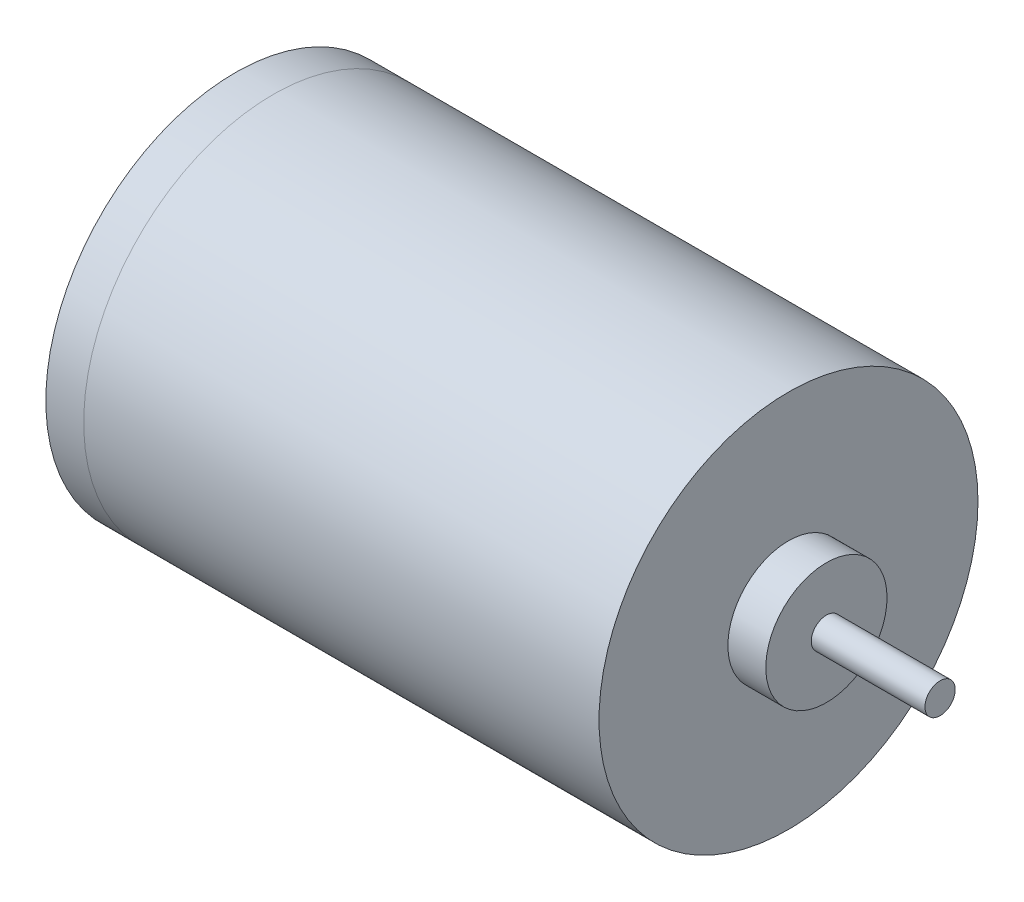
ISO-10303-21;
HEADER;
FILE_DESCRIPTION(('STEP AP214'),'2;1');
FILE_NAME('part.step','',(''),(''),'','','');
FILE_SCHEMA(('AUTOMOTIVE_DESIGN { 1 0 10303 214 1 1 1 1 }'));
ENDSEC;
DATA;
#1=APPLICATION_CONTEXT('core data for automotive mechanical design processes');
#2=APPLICATION_PROTOCOL_DEFINITION('international standard','automotive_design',2000,#1);
#3=PRODUCT_CONTEXT('',#1,'mechanical');
#4=PRODUCT('Part','Part','',(#3));
#5=PRODUCT_RELATED_PRODUCT_CATEGORY('part','',(#4));
#6=PRODUCT_DEFINITION_FORMATION('','',#4);
#7=PRODUCT_DEFINITION_CONTEXT('part definition',#1,'design');
#8=PRODUCT_DEFINITION('design','',#6,#7);
#9=PRODUCT_DEFINITION_SHAPE('','',#8);
#10=(LENGTH_UNIT() NAMED_UNIT(*) SI_UNIT(.MILLI.,.METRE.));
#11=(NAMED_UNIT(*) PLANE_ANGLE_UNIT() SI_UNIT($,.RADIAN.));
#12=(NAMED_UNIT(*) SI_UNIT($,.STERADIAN.) SOLID_ANGLE_UNIT());
#13=UNCERTAINTY_MEASURE_WITH_UNIT(LENGTH_MEASURE(1.E-05),#10,'distance_accuracy_value','');
#14=(GEOMETRIC_REPRESENTATION_CONTEXT(3) GLOBAL_UNCERTAINTY_ASSIGNED_CONTEXT((#13)) GLOBAL_UNIT_ASSIGNED_CONTEXT((#10,
#11,#12)) REPRESENTATION_CONTEXT('',''));
#15=CARTESIAN_POINT('',(0.,0.,0.));
#16=DIRECTION('',(0.,0.,1.));
#17=DIRECTION('',(1.,0.,0.));
#18=AXIS2_PLACEMENT_3D('',#15,#16,#17);
#19=CARTESIAN_POINT('',(39.,0.,0.));
#20=DIRECTION('',(1.,0.,0.));
#21=DIRECTION('',(0.,0.,-1.));
#22=AXIS2_PLACEMENT_3D('',#19,#20,#21);
#23=PLANE('',#22);
#24=CARTESIAN_POINT('',(39.,0.,0.));
#25=DIRECTION('',(1.,0.,0.));
#26=DIRECTION('',(0.,0.,-1.));
#27=AXIS2_PLACEMENT_3D('',#24,#25,#26);
#28=CIRCLE('',#27,4.);
#29=CARTESIAN_POINT('',(39.,0.,-4.));
#30=VERTEX_POINT('',#29);
#31=EDGE_CURVE('E50',#30,#30,#28,.T.);
#32=ORIENTED_EDGE('',*,*,#31,.T.);
#33=EDGE_LOOP('',(#32));
#34=FACE_BOUND('',#33,.T.);
#35=CARTESIAN_POINT('',(39.,0.,0.));
#36=DIRECTION('',(1.,0.,0.));
#37=DIRECTION('',(0.,0.,-1.));
#38=AXIS2_PLACEMENT_3D('',#35,#36,#37);
#39=CIRCLE('',#38,1.);
#40=CARTESIAN_POINT('',(39.,0.,1.));
#41=VERTEX_POINT('',#40);
#42=EDGE_CURVE('E97',#41,#41,#39,.T.);
#43=ORIENTED_EDGE('',*,*,#42,.F.);
#44=EDGE_LOOP('',(#43));
#45=FACE_BOUND('',#44,.T.);
#46=ADVANCED_FACE('F30',(#34,#45),#23,.T.);
#47=CARTESIAN_POINT('',(36.5,0.,0.));
#48=DIRECTION('',(1.,0.,0.));
#49=DIRECTION('',(0.,0.,-1.));
#50=AXIS2_PLACEMENT_3D('',#47,#48,#49);
#51=PLANE('',#50);
#52=CARTESIAN_POINT('',(36.5,0.,0.));
#53=DIRECTION('',(1.,0.,0.));
#54=DIRECTION('',(0.,0.,-1.));
#55=AXIS2_PLACEMENT_3D('',#52,#53,#54);
#56=CIRCLE('',#55,12.501);
#57=CARTESIAN_POINT('',(36.5,0.,-12.501));
#58=VERTEX_POINT('',#57);
#59=EDGE_CURVE('E45',#58,#58,#56,.T.);
#60=ORIENTED_EDGE('',*,*,#59,.T.);
#61=EDGE_LOOP('',(#60));
#62=FACE_BOUND('',#61,.T.);
#63=CARTESIAN_POINT('',(36.5,0.,0.));
#64=DIRECTION('',(1.,0.,0.));
#65=DIRECTION('',(0.,0.,-1.));
#66=AXIS2_PLACEMENT_3D('',#63,#64,#65);
#67=CIRCLE('',#66,4.);
#68=CARTESIAN_POINT('',(36.5,0.,-4.));
#69=VERTEX_POINT('',#68);
#70=EDGE_CURVE('E91',#69,#69,#67,.T.);
#71=ORIENTED_EDGE('',*,*,#70,.F.);
#72=EDGE_LOOP('',(#71));
#73=FACE_BOUND('',#72,.T.);
#74=ADVANCED_FACE('F59',(#62,#73),#51,.T.);
#75=CARTESIAN_POINT('',(2.5,0.,0.));
#76=DIRECTION('',(-1.,0.,0.));
#77=DIRECTION('',(0.,0.,1.));
#78=AXIS2_PLACEMENT_3D('',#75,#76,#77);
#79=CYLINDRICAL_SURFACE('',#78,12.5);
#80=CARTESIAN_POINT('',(2.5,0.,0.));
#81=DIRECTION('',(1.,0.,0.));
#82=DIRECTION('',(0.,0.,-1.));
#83=AXIS2_PLACEMENT_3D('',#80,#81,#82);
#84=CIRCLE('',#83,12.501);
#85=CARTESIAN_POINT('',(2.5,0.,-12.501));
#86=VERTEX_POINT('',#85);
#87=EDGE_CURVE('E10',#86,#86,#84,.T.);
#88=ORIENTED_EDGE('',*,*,#87,.F.);
#89=EDGE_LOOP('',(#88));
#90=FACE_BOUND('',#89,.T.);
#91=CARTESIAN_POINT('',(0.,0.,0.));
#92=DIRECTION('',(1.,0.,0.));
#93=DIRECTION('',(0.,0.,-1.));
#94=AXIS2_PLACEMENT_3D('',#91,#92,#93);
#95=CIRCLE('',#94,12.5);
#96=CARTESIAN_POINT('',(0.,0.,-12.5));
#97=VERTEX_POINT('',#96);
#98=EDGE_CURVE('E40',#97,#97,#95,.T.);
#99=ORIENTED_EDGE('',*,*,#98,.T.);
#100=EDGE_LOOP('',(#99));
#101=FACE_BOUND('',#100,.T.);
#102=ADVANCED_FACE('F32',(#90,#101),#79,.T.);
#103=CARTESIAN_POINT('',(0.,0.,0.));
#104=DIRECTION('',(1.,0.,0.));
#105=DIRECTION('',(0.,0.,-1.));
#106=AXIS2_PLACEMENT_3D('',#103,#104,#105);
#107=PLANE('',#106);
#108=ORIENTED_EDGE('',*,*,#98,.F.);
#109=EDGE_LOOP('',(#108));
#110=FACE_BOUND('',#109,.T.);
#111=ADVANCED_FACE('F58',(#110),#107,.F.);
#112=CARTESIAN_POINT('',(36.5,0.,0.));
#113=DIRECTION('',(-1.,0.,0.));
#114=DIRECTION('',(0.,0.,1.));
#115=AXIS2_PLACEMENT_3D('',#112,#113,#114);
#116=CYLINDRICAL_SURFACE('',#115,12.501);
#117=ORIENTED_EDGE('',*,*,#59,.F.);
#118=EDGE_LOOP('',(#117));
#119=FACE_BOUND('',#118,.T.);
#120=ORIENTED_EDGE('',*,*,#87,.T.);
#121=EDGE_LOOP('',(#120));
#122=FACE_BOUND('',#121,.T.);
#123=ADVANCED_FACE('F64',(#119,#122),#116,.T.);
#124=CARTESIAN_POINT('',(39.,0.,0.));
#125=DIRECTION('',(-1.,0.,0.));
#126=DIRECTION('',(0.,0.,1.));
#127=AXIS2_PLACEMENT_3D('',#124,#125,#126);
#128=CYLINDRICAL_SURFACE('',#127,4.);
#129=ORIENTED_EDGE('',*,*,#31,.F.);
#130=EDGE_LOOP('',(#129));
#131=FACE_BOUND('',#130,.T.);
#132=ORIENTED_EDGE('',*,*,#70,.T.);
#133=EDGE_LOOP('',(#132));
#134=FACE_BOUND('',#133,.T.);
#135=ADVANCED_FACE('F79',(#131,#134),#128,.T.);
#136=CARTESIAN_POINT('',(46.5,0.,0.));
#137=DIRECTION('',(-1.,0.,0.));
#138=DIRECTION('',(0.,0.,1.));
#139=AXIS2_PLACEMENT_3D('',#136,#137,#138);
#140=CYLINDRICAL_SURFACE('',#139,1.);
#141=CARTESIAN_POINT('',(46.5,0.,0.));
#142=DIRECTION('',(1.,0.,0.));
#143=DIRECTION('',(0.,0.,-1.));
#144=AXIS2_PLACEMENT_3D('',#141,#142,#143);
#145=CIRCLE('',#144,1.);
#146=CARTESIAN_POINT('',(46.5,0.,1.));
#147=VERTEX_POINT('',#146);
#148=EDGE_CURVE('E93',#147,#147,#145,.T.);
#149=CARTESIAN_POINT('',(46.5,0.,1.));
#150=CARTESIAN_POINT('',(46.421875,0.,1.));
#151=CARTESIAN_POINT('',(46.34375,0.,1.));
#152=CARTESIAN_POINT('',(46.1875,0.,1.));
#153=CARTESIAN_POINT('',(46.109375,0.,1.));
#154=CARTESIAN_POINT('',(45.953125,0.,1.));
#155=CARTESIAN_POINT('',(45.875,0.,1.));
#156=CARTESIAN_POINT('',(45.71875,0.,1.));
#157=CARTESIAN_POINT('',(45.640625,0.,1.));
#158=CARTESIAN_POINT('',(45.484375,0.,1.));
#159=CARTESIAN_POINT('',(45.40625,0.,1.));
#160=CARTESIAN_POINT('',(45.25,0.,1.));
#161=CARTESIAN_POINT('',(45.171875,0.,1.));
#162=CARTESIAN_POINT('',(45.015625,0.,1.));
#163=CARTESIAN_POINT('',(44.9375,0.,1.));
#164=CARTESIAN_POINT('',(44.78125,0.,1.));
#165=CARTESIAN_POINT('',(44.703125,0.,1.));
#166=CARTESIAN_POINT('',(44.546875,0.,1.));
#167=CARTESIAN_POINT('',(44.46875,0.,1.));
#168=CARTESIAN_POINT('',(44.3125,0.,1.));
#169=CARTESIAN_POINT('',(44.234375,0.,1.));
#170=CARTESIAN_POINT('',(44.078125,0.,1.));
#171=CARTESIAN_POINT('',(44.,0.,1.));
#172=CARTESIAN_POINT('',(43.84375,0.,1.));
#173=CARTESIAN_POINT('',(43.765625,0.,1.));
#174=CARTESIAN_POINT('',(43.609375,0.,1.));
#175=CARTESIAN_POINT('',(43.53125,0.,1.));
#176=CARTESIAN_POINT('',(43.375,0.,1.));
#177=CARTESIAN_POINT('',(43.296875,0.,1.));
#178=CARTESIAN_POINT('',(43.140625,0.,1.));
#179=CARTESIAN_POINT('',(43.0625,0.,1.));
#180=CARTESIAN_POINT('',(42.90625,0.,1.));
#181=CARTESIAN_POINT('',(42.828125,0.,1.));
#182=CARTESIAN_POINT('',(42.671875,0.,1.));
#183=CARTESIAN_POINT('',(42.59375,0.,1.));
#184=CARTESIAN_POINT('',(42.4375,0.,1.));
#185=CARTESIAN_POINT('',(42.359375,0.,1.));
#186=CARTESIAN_POINT('',(42.203125,0.,1.));
#187=CARTESIAN_POINT('',(42.125,0.,1.));
#188=CARTESIAN_POINT('',(41.96875,0.,1.));
#189=CARTESIAN_POINT('',(41.890625,0.,1.));
#190=CARTESIAN_POINT('',(41.734375,0.,1.));
#191=CARTESIAN_POINT('',(41.65625,0.,1.));
#192=CARTESIAN_POINT('',(41.5,0.,1.));
#193=CARTESIAN_POINT('',(41.421875,0.,1.));
#194=CARTESIAN_POINT('',(41.265625,0.,1.));
#195=CARTESIAN_POINT('',(41.1875,0.,1.));
#196=CARTESIAN_POINT('',(41.03125,0.,1.));
#197=CARTESIAN_POINT('',(40.953125,0.,1.));
#198=CARTESIAN_POINT('',(40.796875,0.,1.));
#199=CARTESIAN_POINT('',(40.71875,0.,1.));
#200=CARTESIAN_POINT('',(40.5625,0.,1.));
#201=CARTESIAN_POINT('',(40.484375,0.,1.));
#202=CARTESIAN_POINT('',(40.328125,0.,1.));
#203=CARTESIAN_POINT('',(40.25,0.,1.));
#204=CARTESIAN_POINT('',(40.09375,0.,1.));
#205=CARTESIAN_POINT('',(40.015625,0.,1.));
#206=CARTESIAN_POINT('',(39.859375,0.,1.));
#207=CARTESIAN_POINT('',(39.78125,0.,1.));
#208=CARTESIAN_POINT('',(39.625,0.,1.));
#209=CARTESIAN_POINT('',(39.546875,0.,1.));
#210=CARTESIAN_POINT('',(39.390625,0.,1.));
#211=CARTESIAN_POINT('',(39.3125,0.,1.));
#212=CARTESIAN_POINT('',(39.15625,0.,1.));
#213=CARTESIAN_POINT('',(39.078125,0.,1.));
#214=CARTESIAN_POINT('',(39.,0.,1.));
#215=B_SPLINE_CURVE_WITH_KNOTS('',3,(#149,#150,#151,#152,#153,#154,#155,#156,#157,#158,#159,
#160,#161,#162,#163,#164,#165,#166,#167,#168,#169,#170,#171,#172,#173,#174,#175,#176,#177,#178,
#179,#180,#181,#182,#183,#184,#185,#186,#187,#188,#189,#190,#191,#192,#193,#194,#195,#196,#197,
#198,#199,#200,#201,#202,#203,#204,#205,#206,#207,#208,#209,#210,#211,#212,#213,#214),
.UNSPECIFIED.,.F.,.F.,(4,2,2,2,2,2,2,2,2,2,2,2,2,2,2,2,2,2,2,2,2,2,2,2,2,2,2,2,2,2,2,2,4),(0.,
0.234374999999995,0.468749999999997,0.703124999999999,0.937499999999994,1.171875,1.40625,
1.640625,1.87499999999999,2.109375,2.34375,2.57812499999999,2.8125,3.046875,3.28125,
3.51562499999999,3.75,3.984375,4.21874999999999,4.453125,4.6875,4.921875,5.15624999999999,
5.390625,5.625,5.859375,6.09374999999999,6.328125,6.5625,6.79687499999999,7.03125,7.265625,7.5),.UNSPECIFIED.);
#216=EDGE_CURVE('BSEAM77',#147,#41,#215,.T.);
#217=ORIENTED_EDGE('',*,*,#148,.F.);
#218=ORIENTED_EDGE('',*,*,#42,.T.);
#219=ORIENTED_EDGE('',*,*,#216,.T.);
#220=ORIENTED_EDGE('',*,*,#216,.F.);
#221=EDGE_LOOP('',(#217,#219,#218,#220));
#222=FACE_BOUND('',#221,.T.);
#223=ADVANCED_FACE('F77',(#222),#140,.T.);
#224=CARTESIAN_POINT('',(46.5,0.,0.));
#225=DIRECTION('',(1.,0.,0.));
#226=DIRECTION('',(0.,0.,-1.));
#227=AXIS2_PLACEMENT_3D('',#224,#225,#226);
#228=PLANE('',#227);
#229=ORIENTED_EDGE('',*,*,#148,.T.);
#230=EDGE_LOOP('',(#229));
#231=FACE_BOUND('',#230,.T.);
#232=ADVANCED_FACE('F104',(#231),#228,.T.);
#233=CLOSED_SHELL('',(#46,#74,#102,#111,#123,#135,#223,#232));
#234=MANIFOLD_SOLID_BREP('B2',#233);
#235=ADVANCED_BREP_SHAPE_REPRESENTATION('',(#18,#234),#14);
#236=SHAPE_DEFINITION_REPRESENTATION(#9,#235);
ENDSEC;
END-ISO-10303-21;
